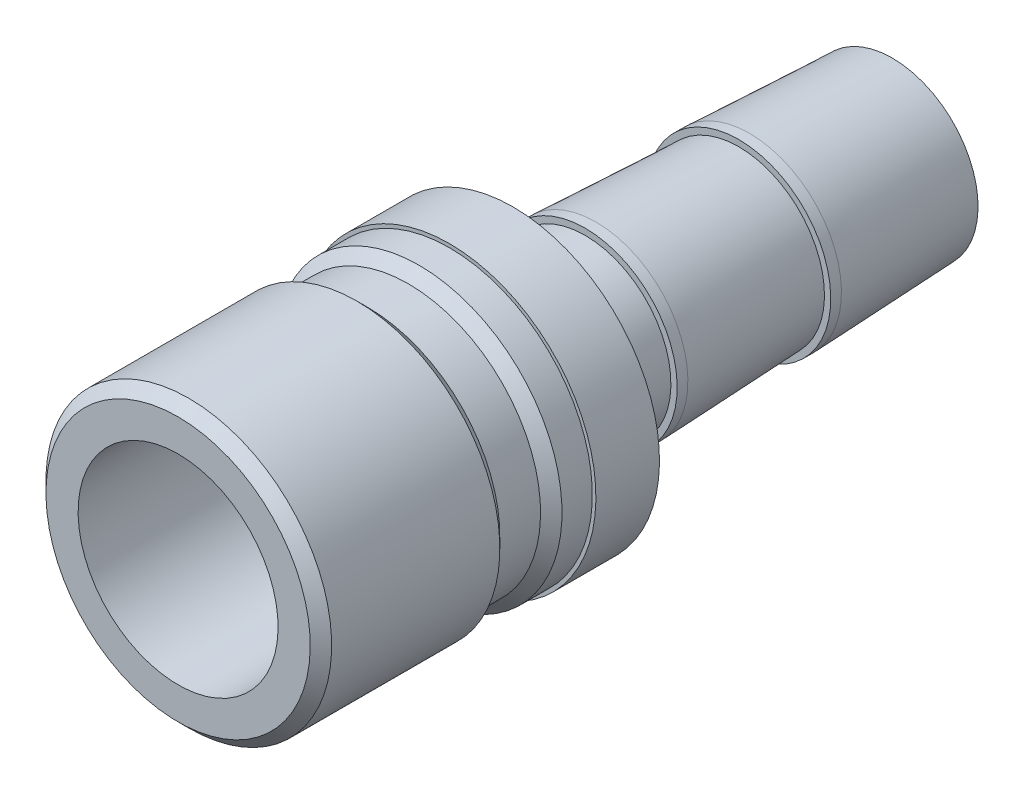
from build123d import *


with BuildPart() as part:
    # Sketch1 → Revolve1 (revolve)
    with BuildSketch(Plane(origin=(0, 0, 0), x_dir=(0, 0, -1), z_dir=(1, 0, 0))):
        Polygon((-19.304, 7.112), (-19.304, 9.398), (-18.542, 10.16), (-6.5786, 10.16), (-5.8166, 9.398), (-2.921, 9.398), (-2.159, 10.16), (0, 10.16), (0, 10.414), (4.5212, 10.414), (4.5212, 6.5405), (7.366, 6.096), (9.652, 6.096), (9.652, 6.5405), (10.414, 6.5405), (20.574, 6.096), (20.574, 6.5405), (21.336, 6.5405), (31.496, 6.096), (31.496, 5.159375), (-3.660770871, 5.159375), (-4.699, 7.112), align=None)
    revolve(axis=Axis((0, 0, 0), (0, 0, 1)))


solid = part.part
